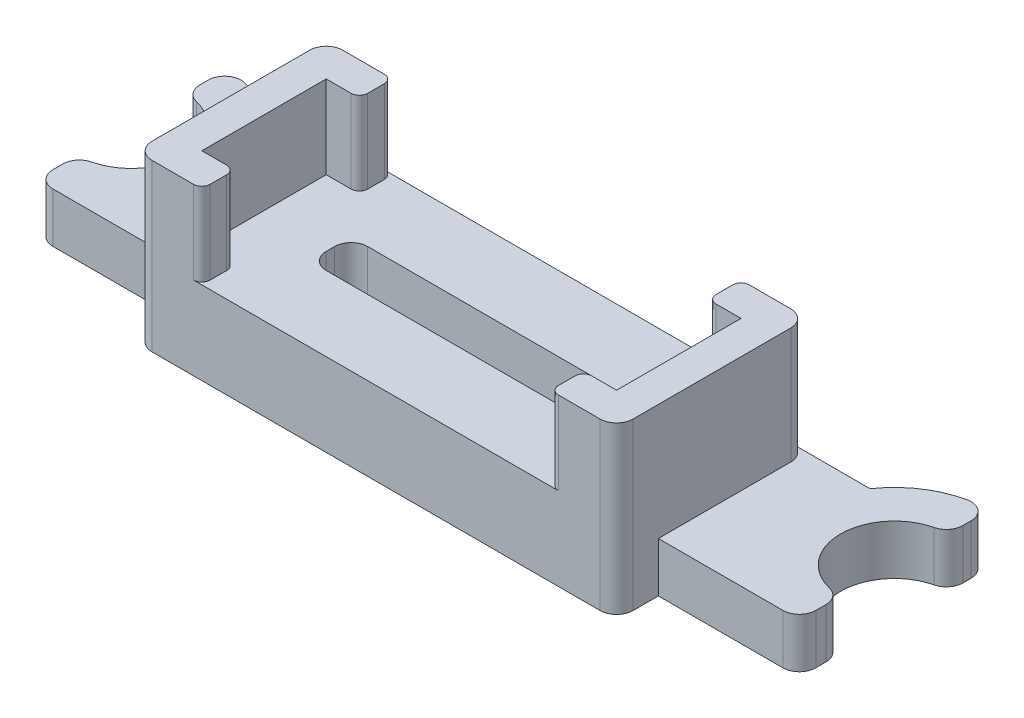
from build123d import *

# Parameters (mm, degrees)
MAIN_BODY_DEPTH            = 3
SKETCH2_W                  = 29
SKETCH2_H                  = 11.5
FAN_OFFSET_DEPTH           = 2
FAN_FRAME_DEPTH            = 5
SKETCH4_W                  = 17
SKETCH4_H                  = 2.5
SPEED_HOLE_DEPTH           = 25.941180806
CONTOURING_R               = 1
FIT_CLEARANCE_CONTOURING_R = 0.5


with BuildPart() as part:
    # Sketch1 → Main Body (new body)
    with BuildSketch(Plane(origin=(0, 0, 0), x_dir=(1, 0, 0), z_dir=(0, 1, 0))):
        with BuildLine():
            Line((-23, -3.25), (-23, -5.73))
            Line((-23, -5.73), (-14.5, -5.73))
            Line((-14.5, -5.73), (-14.5, -8.25))
            Line((-14.5, -8.25), (14.5, -8.25))
            Line((14.5, -8.25), (14.5, -5.73))
            Line((14.5, -5.73), (23, -5.73))
            Line((23, -5.73), (23, -3.25))
            ThreePointArc((23, -3.25), (19.75, 0), (23, 3.25))
            Line((23, 3.25), (23, 5.73))
            ThreePointArc((23, 5.73), (20.334441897, 5.072248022), (18.280847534, 3.25))
            Line((18.280847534, 3.25), (-18.280847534, 3.25))
            ThreePointArc((-18.280847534, 3.25), (-20.334441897, 5.072248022), (-23, 5.73))
            Line((-23, 5.73), (-23, 3.25))
            ThreePointArc((-23, 3.25), (-19.75, 0), (-23, -3.25))
        make_face()
    extrude(amount=MAIN_BODY_DEPTH)

    # Sketch2 → Fan Offset (add)
    with BuildSketch(Plane(origin=(0, 3, 0), x_dir=(1, 0, 0), z_dir=(0, 1, 0))):
        with Locations((0, -2.5)):
            Rectangle(SKETCH2_W, SKETCH2_H)
    extrude(amount=FAN_OFFSET_DEPTH)

    # Sketch3 → Fan Frame (add)
    with BuildSketch(Plane(origin=(0, 5, 0), x_dir=(1, 0, 0), z_dir=(0, 1, 0))):
        Polygon((-10.5, 3.25), (-14.5, 3.25), (-14.5, -8.25), (-10.5, -8.25), (-10.5, -6.25), (-12.5, -6.25), (-12.5, 1.25), (-10.5, 1.25), align=None)
        Polygon((12.5, -6.25), (12.5, 1.25), (10.5, 1.25), (10.5, 3.25), (14.5, 3.25), (14.5, -8.25), (10.5, -8.25), (10.5, -6.25), align=None)
    extrude(amount=FAN_FRAME_DEPTH)

    # Sketch4 → Speed Hole (cut, through all)
    with BuildSketch(Plane(origin=(0, 5, 0), x_dir=(1, 0, 0), z_dir=(0, 1, 0))):
        with Locations((0, -2.5)):
            Rectangle(SKETCH4_W, SKETCH4_H)
    extrude(amount=-SPEED_HOLE_DEPTH, mode=Mode.SUBTRACT)

    # Contouring
    contouring_edges = [part.edges().sort_by_distance(p)[0] for p in [
        (-14.5, 6.5, -3.25),
        (14.5, 6.5, -3.25),
        (14.5, 5, 8.25),
        (-14.5, 5, 8.25),
        (23, 1.5, 5.73),
        (23, 1.5, 3.25),
        (23, 1.5, -3.25),
        (23, 1.5, -5.73),
        (-23, 1.5, 5.73),
        (-23, 1.5, 3.25),
        (-23, 1.5, -3.25),
        (-23, 1.5, -5.73),
        (-8.5, 2.5, 1.25),
        (-8.5, 2.5, 3.75),
        (8.5, 2.5, 3.75),
        (8.5, 2.5, 1.25),
    ]]
    fillet(contouring_edges, radius=CONTOURING_R)

    # Fit Clearance - Contouring
    fit_clearance_contouring_edges = [part.edges().sort_by_distance(p)[0] for p in [
        (10.5, 7.5, -3.25),
        (-10.5, 7.5, -3.25),
        (-10.5, 7.5, 8.25),
        (-10.5, 7.5, 6.25),
        (10.5, 7.5, 8.25),
        (10.5, 7.5, 6.25),
        (10.5, 7.5, -1.25),
        (-10.5, 7.5, -1.25),
    ]]
    fillet(fit_clearance_contouring_edges, radius=FIT_CLEARANCE_CONTOURING_R)


solid = part.part
